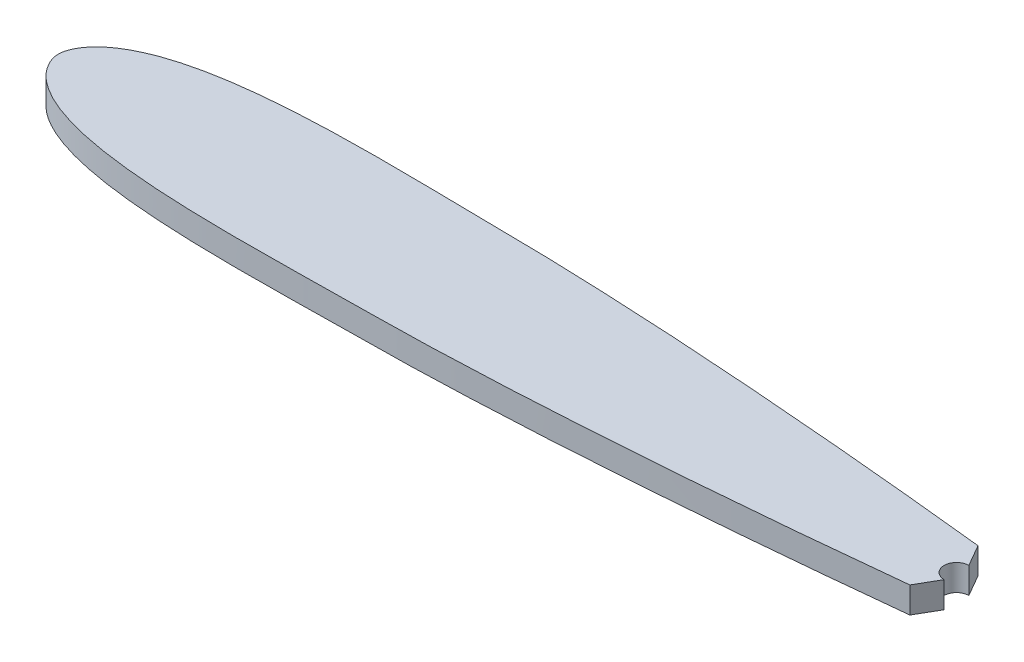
from build123d import *

# Parameters (mm, degrees)
BOSS_EXTRUDE1_DEPTH     = 3.175
SKETCH2_R               = 1.5
CUT_EXTRUDE1_DEPTH      = 3.175
SKETCH3_R               = 1.5
CUT_EXTRUDE2_DEPTH      = 1.5875
CUT_EXTRUDE3_DEPTH      = 75.025896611
CUT_EXTRUDE3_DEPTH_BACK = 75.025896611
CUT_EXTRUDE4_DEPTH      = 75.025896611
CUT_EXTRUDE4_DEPTH_BACK = 75.025896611


with BuildPart() as part:
    # Sketch1 → Boss-Extrude1 (new body)
    with BuildSketch(Plane(origin=(0, 0, 0), x_dir=(1, 0, 0), z_dir=(0, 1, 0))):
        with BuildLine():
            Line((67.779039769, 0.131246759), (67.797892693, 0.119555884))
            add(Edge.make_bspline(
                [(67.779039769, 0.131246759), (65.03700686, 0.509034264), (59.965261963, 1.213250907), (52.554471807, 2.158374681), (45.554393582, 3.00647836), (36.223889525, 4.068832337), (26.890333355, 5.041842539), (17.553968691, 5.919437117), (10.553820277, 6.521297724), (3.553925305, 7.068029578), (-3.492800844, 7.550143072), (-10.539316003, 7.962714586), (-17.586579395, 8.268185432), (-24.587039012, 8.49389358), (-30.375678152, 8.4899488), (-34.994971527, 8.597521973), (-40.781764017, 8.678102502), (-47.788121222, 8.68162886), (-54.793770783, 8.311674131), (-59.226305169, 7.818234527), (-62.265674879, 7.319870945), (-64.600903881, 6.788432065), (-66.462046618, 6.225735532), (-67.870705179, 5.710888), (-69.287641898, 5.065294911), (-70.729671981, 4.219380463), (-71.925873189, 3.230084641), (-72.979383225, 1.905868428), (-73.75481754, 0.124102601), (-72.979383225, -1.657663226), (-71.925873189, -2.981879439), (-70.729671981, -3.971175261), (-69.287641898, -4.817089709), (-67.870705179, -5.462682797), (-66.462046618, -5.97753033), (-64.600903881, -6.540226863), (-62.265674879, -7.071665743), (-59.226305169, -7.570029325), (-54.793770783, -8.063468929), (-47.788121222, -8.433423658), (-40.781764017, -8.4298973), (-34.994971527, -8.349316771), (-30.375678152, -8.241743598), (-24.587039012, -8.245688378), (-17.586579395, -8.01998023), (-10.539316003, -7.714509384), (-3.492800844, -7.30193787), (3.553925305, -6.819824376), (10.553820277, -6.273092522), (17.553968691, -5.671231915), (26.890333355, -4.793637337), (36.223889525, -3.820627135), (45.554393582, -2.758273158), (52.554471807, -1.910169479), (59.971554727, -0.964243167), (65.049573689, -0.259084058), (67.797892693, 0.119555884)],
                knots=[-0.004320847, -0.004320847, -0.004320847, -0.004320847, 0.024634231, 0.04924287, 0.07382978, 0.098396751, 0.147478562, 0.171994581, 0.196493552, 0.220976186, 0.245442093, 0.270380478, 0.294812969, 0.319231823, 0.343641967, 0.355360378, 0.36756608, 0.404182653, 0.428636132, 0.440920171, 0.450818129, 0.460843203, 0.465945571, 0.471149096, 0.476522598, 0.482208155, 0.488618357, 0.492567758, 0.5, 0.507432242, 0.511381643, 0.517791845, 0.523477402, 0.528850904, 0.534054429, 0.539156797, 0.549181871, 0.559079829, 0.571363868, 0.595817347, 0.63243392, 0.644639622, 0.656358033, 0.680768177, 0.705187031, 0.729619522, 0.754557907, 0.779023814, 0.803506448, 0.828005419, 0.852521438, 0.901603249, 0.92617022, 0.95075713, 0.975365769, 1.004387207, 1.004387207, 1.004387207, 1.004387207], degree=3))
        make_face()
    extrude(amount=BOSS_EXTRUDE1_DEPTH)

    # Sketch2 → Cut-Extrude1 (cut)
    with BuildSketch(Plane(origin=(0, 3.175, 0), x_dir=(1, 0, 0), z_dir=(0, 1, 0))):
        with Locations(Location((35.779039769, 0.131246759, 0), (0, 0, 270))):
            Circle(SKETCH2_R)
    extrude(amount=-CUT_EXTRUDE1_DEPTH, mode=Mode.SUBTRACT)

    # Sketch3 → Cut-Extrude2 (cut)
    with BuildSketch(Plane.XZ):
        with Locations(Location((-52.19848551, -0.119555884, 0), (0, 0, 270))):
            Circle(SKETCH3_R)
    extrude(amount=-CUT_EXTRUDE2_DEPTH, mode=Mode.SUBTRACT)

    # Sketch4 → Cut-Extrude3 (cut, two sides: drawn at the far end of the back side and taken through both)
    with BuildSketch(Plane(origin=(0, 3.175, 0), x_dir=(1, 0, 0), z_dir=(0, 1, 0)).offset(-CUT_EXTRUDE3_DEPTH_BACK)):
        with BuildLine():
            Line((35.779039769, 4.09956648), (35.779039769, 1.631246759))
            ThreePointArc((35.779039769, 1.631246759), (37.279039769, 0.131246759), (35.779039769, -1.368753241))
            Line((35.779039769, -1.368753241), (35.779039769, -3.851361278))
            add(Edge.make_bspline(
                [(35.779039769, -3.851361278), (36.703324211, -3.751450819), (39.962012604, -3.395011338), (45.554393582, -2.758273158), (52.554471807, -1.910169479), (59.971554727, -0.964243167), (65.049573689, -0.259084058), (67.797892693, 0.119555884)],
                knots=[0.891878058, 0.891878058, 0.891878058, 0.891878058, 0.901603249, 0.92617022, 0.95075713, 0.975365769, 1.004387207, 1.004387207, 1.004387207, 1.004387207], degree=3))
            Line((67.797892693, 0.119555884), (67.779039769, 0.131246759))
            add(Edge.make_bspline(
                [(67.779039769, 0.131246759), (65.03700686, 0.509034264), (59.965261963, 1.213250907), (52.554471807, 2.158374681), (45.554393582, 3.00647836), (39.962012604, 3.64321654), (36.703324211, 3.999656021), (35.779039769, 4.09956648)],
                knots=[-0.004320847, -0.004320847, -0.004320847, -0.004320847, 0.024634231, 0.04924287, 0.07382978, 0.098396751, 0.108121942, 0.108121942, 0.108121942, 0.108121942], degree=3))
        make_face()
    extrude(amount=CUT_EXTRUDE3_DEPTH + CUT_EXTRUDE3_DEPTH_BACK, mode=Mode.SUBTRACT)

    # Sketch5 → Cut-Extrude4 (cut, two sides: drawn at the far end of the back side and taken through both)
    with BuildSketch(Plane(origin=(0, 3.175, 0), x_dir=(1, 0, 0), z_dir=(0, 1, 0)).offset(-CUT_EXTRUDE4_DEPTH_BACK)):
        with BuildLine():
            Line((35.779039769, 1.631246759), (34.259720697, 4.262784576))
            add(Edge.make_bspline(
                [(35.779039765, 4.099627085), (35.272638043, 4.15436654), (34.766198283, 4.208753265), (34.259720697, 4.262784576)],
                knots=[0.108121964, 0.108121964, 0.108121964, 0.108121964, 0.113450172, 0.113450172, 0.113450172, 0.113450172], degree=3))
            Line((35.779039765, 4.099627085), (35.779039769, 1.631246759))
        make_face()
        with BuildLine():
            Line((35.779039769, -1.368753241), (34.250930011, -4.015516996))
            add(Edge.make_bspline(
                [(34.250930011, -4.015516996), (34.760338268, -3.961177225), (35.269708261, -3.906477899), (35.779039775, -3.85142175)],
                knots=[0.886519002, 0.886519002, 0.886519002, 0.886519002, 0.891878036, 0.891878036, 0.891878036, 0.891878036], degree=3))
            Line((35.779039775, -3.85142175), (35.779039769, -1.368753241))
        make_face()
    extrude(amount=CUT_EXTRUDE4_DEPTH + CUT_EXTRUDE4_DEPTH_BACK, mode=Mode.SUBTRACT)


solid = part.part
